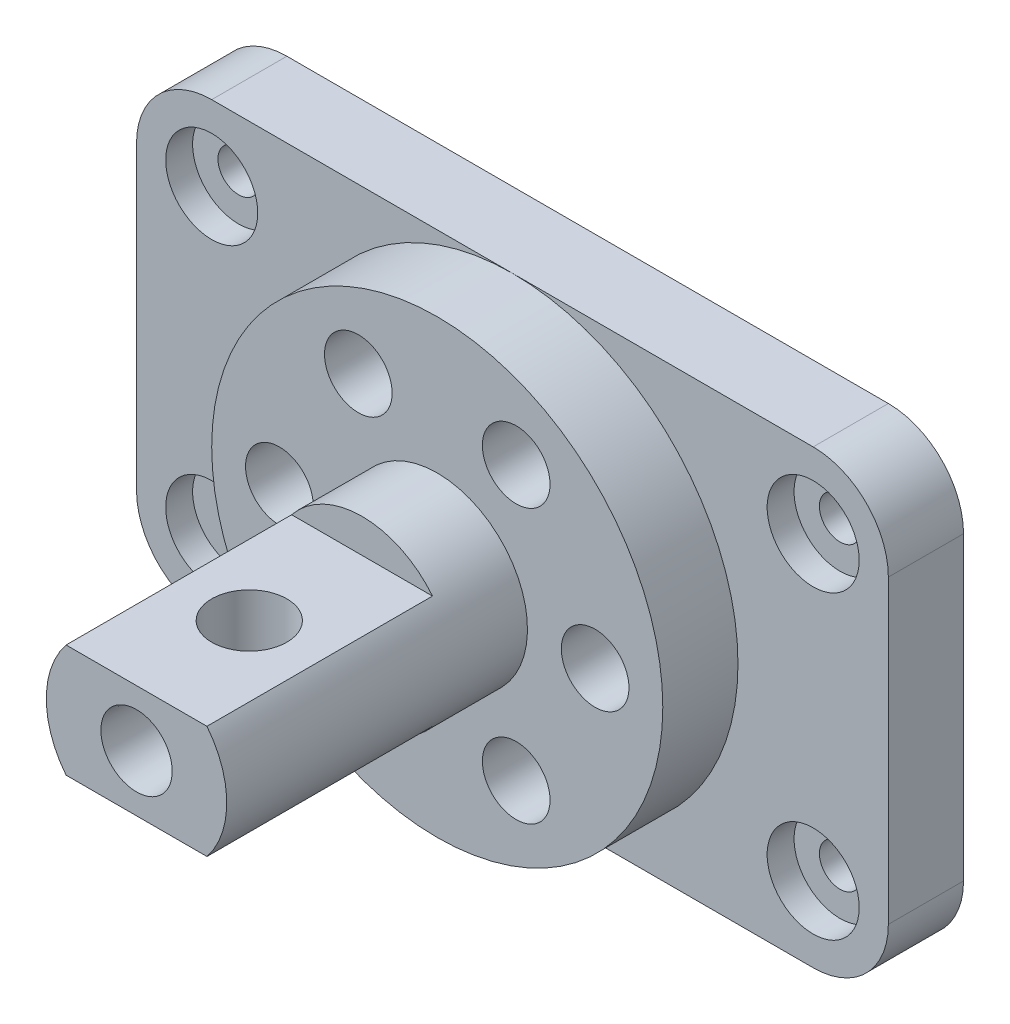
from build123d import *

# Parameters (mm, degrees)
M10X1_0_TAPPED_HOLE2_D                  = 9
CIRPATTERN1_COUNT                       = 6
CUT_EXTRUDE1_START                      = -30
CUT_EXTRUDE1_DEPTH                      = 30
SKETCH9_R                               = 5
CUT_EXTRUDE2_DEPTH                      = 15
EXTRUDE1_DEPTH                          = 10
CBORE_FOR_M5_HEX_HEAD_BOLT1_D           = 5.5
CBORE_FOR_M5_HEX_HEAD_BOLT1_CBORE_D     = 12.24
CBORE_FOR_M5_HEX_HEAD_BOLT1_CBORE_DEPTH = 3.58
SKETCH13_R                              = 15
CUT_EXTRUDE3_DEPTH                      = 5


with BuildPart() as part:
    # Sketch2 → Revolve1 (revolve)
    with BuildSketch(Plane(origin=(0, 0, 0), x_dir=(0, 0, -1), z_dir=(1, 0, 0))):
        Polygon((0, 0), (0, 12), (40, 12), (40, 30), (50, 30), (50, 0), align=None)
    revolve(axis=Axis((0, 0, -50), (0, 0, 1)))

    # Sketch4 → 1_8 NPT Tapped Hole1 (revolve, cut)
    with BuildSketch(Plane(origin=(0, 0, 0), x_dir=(0, -1, 0), z_dir=(1, 0, 0))):
        Polygon((0, 0), (0, 14.133468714), (4.2164, 11.6), (4.2164, 6.9), (4.53740086, 6.9), (4.7439961, 0), align=None)
    revolve(axis=Axis((0, 0, 6.35), (0, 0, -1)), mode=Mode.SUBTRACT)

    # M10x1.0 Tapped Hole2 (through all)
    with Locations(Plane.XY.offset(-40)):
        with Locations((21, 0)):
            m10x1_0_tapped_hole2 = Hole(M10X1_0_TAPPED_HOLE2_D / 2)

    # CirPattern1: M10x1.0 Tapped Hole2 ×6 about axis
    cirpattern1_axis = Axis((0, 0, 0), (0, 0, 1))
    for i in range(1, CIRPATTERN1_COUNT):
        add(m10x1_0_tapped_hole2.rotate(cirpattern1_axis, i * 360 / CIRPATTERN1_COUNT), mode=Mode.SUBTRACT)

    # Sketch8 → Cut-Extrude1 (cut)
    with BuildSketch(Plane.XY.offset(CUT_EXTRUDE1_START)):
        with BuildLine():
            Line((9.367496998, -7.5), (-9.367496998, -7.5))
            ThreePointArc((-9.367496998, -7.5), (0, -12), (9.367496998, -7.5))
        make_face()
        with BuildLine():
            Line((9.367496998, 7.5), (-9.367496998, 7.5))
            ThreePointArc((-9.367496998, 7.5), (0, 12), (9.367496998, 7.5))
        make_face()
    extrude(amount=CUT_EXTRUDE1_DEPTH, mode=Mode.SUBTRACT)

    # Sketch9 → Cut-Extrude2 (cut)
    with BuildSketch(Plane(origin=(0, 7.5, 0), x_dir=(-1, 0, 0), z_dir=(0, 1, 0))):
        with Locations(Location((0, -15, 0), (0, 0, 90))):
            Circle(SKETCH9_R)
    extrude(amount=-CUT_EXTRUDE2_DEPTH, mode=Mode.SUBTRACT)

    # Sketch10 → Extrude1 (add)
    with BuildSketch(Plane(origin=(0, 0, -50), x_dir=(-1, 0, 0), z_dir=(0, 0, -1))):
        with BuildLine():
            Line((40, 30), (-40, 30))
            ThreePointArc((-40, 30), (-47.071067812, 27.071067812), (-50, 20))
            Line((-50, 20), (-50, -20))
            ThreePointArc((-50, -20), (-47.071067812, -27.071067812), (-40, -30))
            Line((-40, -30), (40, -30))
            ThreePointArc((40, -30), (47.071067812, -27.071067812), (50, -20))
            Line((50, -20), (50, 20))
            ThreePointArc((50, 20), (47.071067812, 27.071067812), (40, 30))
        make_face()
    extrude(amount=EXTRUDE1_DEPTH)

    # CBORE for M5 Hex Head Bolt1 (through all)
    with Locations(Plane.XY.offset(-50)):
        with Locations((-40, 20), (40, 20), (40, -20), (-40, -20)):
            CounterBoreHole(CBORE_FOR_M5_HEX_HEAD_BOLT1_D / 2, CBORE_FOR_M5_HEX_HEAD_BOLT1_CBORE_D / 2, CBORE_FOR_M5_HEX_HEAD_BOLT1_CBORE_DEPTH)

    # Sketch13 → Cut-Extrude3 (cut)
    with BuildSketch(Plane(origin=(0, 0, -60), x_dir=(-1, 0, 0), z_dir=(0, 0, -1))):
        with Locations(Location((0, 0, 0), (0, 0, 90))):
            Circle(SKETCH13_R)
    extrude(amount=-CUT_EXTRUDE3_DEPTH, mode=Mode.SUBTRACT)


solid = part.part
